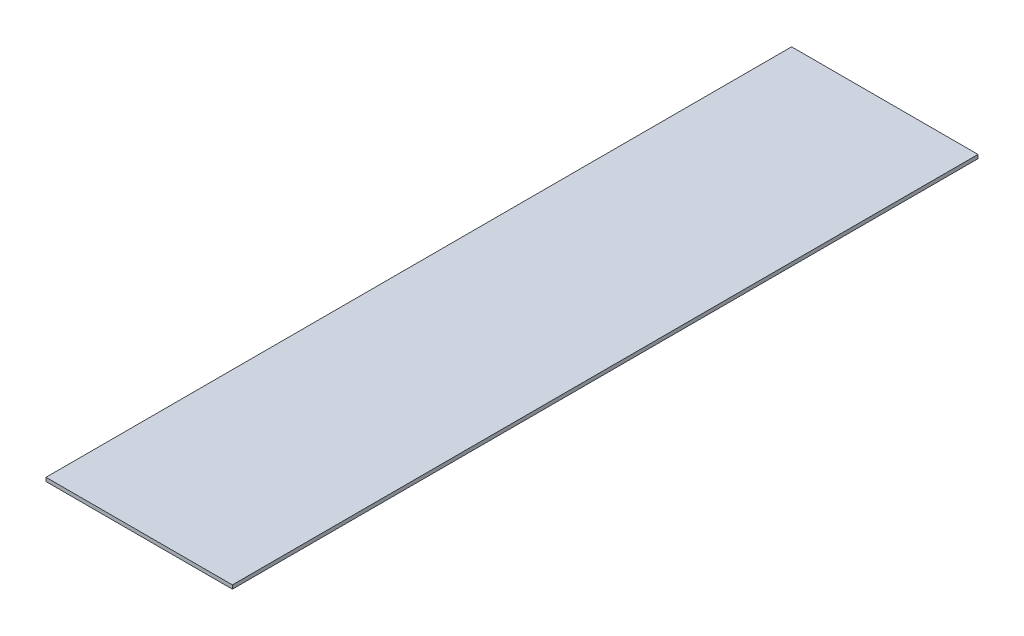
ISO-10303-21;
HEADER;
FILE_DESCRIPTION(('STEP AP214'),'2;1');
FILE_NAME('part.step','',(''),(''),'','','');
FILE_SCHEMA(('AUTOMOTIVE_DESIGN { 1 0 10303 214 1 1 1 1 }'));
ENDSEC;
DATA;
#1=APPLICATION_CONTEXT('core data for automotive mechanical design processes');
#2=APPLICATION_PROTOCOL_DEFINITION('international standard','automotive_design',2000,#1);
#3=PRODUCT_CONTEXT('',#1,'mechanical');
#4=PRODUCT('Part','Part','',(#3));
#5=PRODUCT_RELATED_PRODUCT_CATEGORY('part','',(#4));
#6=PRODUCT_DEFINITION_FORMATION('','',#4);
#7=PRODUCT_DEFINITION_CONTEXT('part definition',#1,'design');
#8=PRODUCT_DEFINITION('design','',#6,#7);
#9=PRODUCT_DEFINITION_SHAPE('','',#8);
#10=(LENGTH_UNIT() NAMED_UNIT(*) SI_UNIT(.MILLI.,.METRE.));
#11=(NAMED_UNIT(*) PLANE_ANGLE_UNIT() SI_UNIT($,.RADIAN.));
#12=(NAMED_UNIT(*) SI_UNIT($,.STERADIAN.) SOLID_ANGLE_UNIT());
#13=UNCERTAINTY_MEASURE_WITH_UNIT(LENGTH_MEASURE(1.E-05),#10,'distance_accuracy_value','');
#14=(GEOMETRIC_REPRESENTATION_CONTEXT(3) GLOBAL_UNCERTAINTY_ASSIGNED_CONTEXT((#13)) GLOBAL_UNIT_ASSIGNED_CONTEXT((#10,
#11,#12)) REPRESENTATION_CONTEXT('',''));
#15=CARTESIAN_POINT('',(0.,0.,0.));
#16=DIRECTION('',(0.,0.,1.));
#17=DIRECTION('',(1.,0.,0.));
#18=AXIS2_PLACEMENT_3D('',#15,#16,#17);
#19=CARTESIAN_POINT('',(152.4,2.54,0.));
#20=DIRECTION('',(-1.,0.,0.));
#21=DIRECTION('',(0.,0.,1.));
#22=AXIS2_PLACEMENT_3D('',#19,#20,#21);
#23=PLANE('',#22);
#24=DIRECTION('',(0.,1.,0.));
#25=VECTOR('',#24,1.);
#26=CARTESIAN_POINT('',(152.4,2.54,25.4));
#27=LINE('',#26,#25);
#28=CARTESIAN_POINT('',(152.4,2.413,25.4));
#29=VERTEX_POINT('',#28);
#30=CARTESIAN_POINT('',(152.4,2.667,25.4));
#31=VERTEX_POINT('',#30);
#32=EDGE_CURVE('E11',#29,#31,#27,.T.);
#33=ORIENTED_EDGE('',*,*,#32,.F.);
#34=DIRECTION('',(0.,0.,1.));
#35=VECTOR('',#34,1.);
#36=CARTESIAN_POINT('',(152.4,2.413,0.));
#37=LINE('',#36,#35);
#38=CARTESIAN_POINT('',(152.4,2.413,-25.4));
#39=VERTEX_POINT('',#38);
#40=EDGE_CURVE('E94',#29,#39,#37,.F.);
#41=ORIENTED_EDGE('',*,*,#40,.T.);
#42=DIRECTION('',(0.,1.,0.));
#43=VECTOR('',#42,1.);
#44=CARTESIAN_POINT('',(152.4,2.54,-25.4));
#45=LINE('',#44,#43);
#46=CARTESIAN_POINT('',(152.4,2.667,-25.4));
#47=VERTEX_POINT('',#46);
#48=EDGE_CURVE('E49',#39,#47,#45,.T.);
#49=ORIENTED_EDGE('',*,*,#48,.T.);
#50=DIRECTION('',(0.,0.,1.));
#51=VECTOR('',#50,1.);
#52=CARTESIAN_POINT('',(152.4,2.667,0.));
#53=LINE('',#52,#51);
#54=EDGE_CURVE('E107',#31,#47,#53,.F.);
#55=ORIENTED_EDGE('',*,*,#54,.F.);
#56=EDGE_LOOP('',(#33,#41,#49,#55));
#57=FACE_BOUND('',#56,.T.);
#58=ADVANCED_FACE('F39',(#57),#23,.F.);
#59=CARTESIAN_POINT('',(0.,2.54,-25.4));
#60=DIRECTION('',(0.,0.,1.));
#61=DIRECTION('',(1.,0.,0.));
#62=AXIS2_PLACEMENT_3D('',#59,#60,#61);
#63=PLANE('',#62);
#64=ORIENTED_EDGE('',*,*,#48,.F.);
#65=DIRECTION('',(1.,0.,0.));
#66=VECTOR('',#65,1.);
#67=CARTESIAN_POINT('',(0.,2.413,-25.4));
#68=LINE('',#67,#66);
#69=CARTESIAN_POINT('',(139.7,2.413,-25.4));
#70=VERTEX_POINT('',#69);
#71=EDGE_CURVE('E101',#39,#70,#68,.F.);
#72=ORIENTED_EDGE('',*,*,#71,.T.);
#73=DIRECTION('',(0.,1.,0.));
#74=VECTOR('',#73,1.);
#75=CARTESIAN_POINT('',(139.7,2.54,-25.4));
#76=LINE('',#75,#74);
#77=CARTESIAN_POINT('',(139.7,2.667,-25.4));
#78=VERTEX_POINT('',#77);
#79=EDGE_CURVE('E57',#70,#78,#76,.T.);
#80=ORIENTED_EDGE('',*,*,#79,.T.);
#81=DIRECTION('',(1.,0.,0.));
#82=VECTOR('',#81,1.);
#83=CARTESIAN_POINT('',(0.,2.667,-25.4));
#84=LINE('',#83,#82);
#85=EDGE_CURVE('E88',#47,#78,#84,.F.);
#86=ORIENTED_EDGE('',*,*,#85,.F.);
#87=EDGE_LOOP('',(#64,#72,#80,#86));
#88=FACE_BOUND('',#87,.T.);
#89=ADVANCED_FACE('F111',(#88),#63,.F.);
#90=CARTESIAN_POINT('',(139.7,2.54,0.));
#91=DIRECTION('',(-1.,0.,0.));
#92=DIRECTION('',(0.,0.,1.));
#93=AXIS2_PLACEMENT_3D('',#90,#91,#92);
#94=PLANE('',#93);
#95=ORIENTED_EDGE('',*,*,#79,.F.);
#96=DIRECTION('',(0.,0.,1.));
#97=VECTOR('',#96,1.);
#98=CARTESIAN_POINT('',(139.7,2.413,0.));
#99=LINE('',#98,#97);
#100=CARTESIAN_POINT('',(139.7,2.413,25.4));
#101=VERTEX_POINT('',#100);
#102=EDGE_CURVE('E93',#101,#70,#99,.F.);
#103=ORIENTED_EDGE('',*,*,#102,.F.);
#104=DIRECTION('',(0.,1.,0.));
#105=VECTOR('',#104,1.);
#106=CARTESIAN_POINT('',(139.7,2.54,25.4));
#107=LINE('',#106,#105);
#108=CARTESIAN_POINT('',(139.7,2.667,25.4));
#109=VERTEX_POINT('',#108);
#110=EDGE_CURVE('E43',#101,#109,#107,.T.);
#111=ORIENTED_EDGE('',*,*,#110,.T.);
#112=DIRECTION('',(0.,0.,1.));
#113=VECTOR('',#112,1.);
#114=CARTESIAN_POINT('',(139.7,2.667,0.));
#115=LINE('',#114,#113);
#116=EDGE_CURVE('E103',#109,#78,#115,.F.);
#117=ORIENTED_EDGE('',*,*,#116,.T.);
#118=EDGE_LOOP('',(#95,#103,#111,#117));
#119=FACE_BOUND('',#118,.T.);
#120=ADVANCED_FACE('F96',(#119),#94,.T.);
#121=CARTESIAN_POINT('',(0.,2.54,25.4));
#122=DIRECTION('',(0.,0.,1.));
#123=DIRECTION('',(1.,0.,0.));
#124=AXIS2_PLACEMENT_3D('',#121,#122,#123);
#125=PLANE('',#124);
#126=DIRECTION('',(1.,0.,0.));
#127=VECTOR('',#126,1.);
#128=CARTESIAN_POINT('',(0.,2.413,25.4));
#129=LINE('',#128,#127);
#130=EDGE_CURVE('E82',#101,#29,#129,.T.);
#131=ORIENTED_EDGE('',*,*,#130,.T.);
#132=ORIENTED_EDGE('',*,*,#32,.T.);
#133=DIRECTION('',(1.,0.,0.));
#134=VECTOR('',#133,1.);
#135=CARTESIAN_POINT('',(0.,2.667,25.4));
#136=LINE('',#135,#134);
#137=EDGE_CURVE('E84',#109,#31,#136,.T.);
#138=ORIENTED_EDGE('',*,*,#137,.F.);
#139=ORIENTED_EDGE('',*,*,#110,.F.);
#140=EDGE_LOOP('',(#131,#132,#138,#139));
#141=FACE_BOUND('',#140,.T.);
#142=ADVANCED_FACE('F41',(#141),#125,.T.);
#143=CARTESIAN_POINT('',(0.,2.667,0.));
#144=DIRECTION('',(0.,1.,0.));
#145=DIRECTION('',(0.,0.,1.));
#146=AXIS2_PLACEMENT_3D('',#143,#144,#145);
#147=PLANE('',#146);
#148=ORIENTED_EDGE('',*,*,#116,.F.);
#149=ORIENTED_EDGE('',*,*,#137,.T.);
#150=ORIENTED_EDGE('',*,*,#54,.T.);
#151=ORIENTED_EDGE('',*,*,#85,.T.);
#152=EDGE_LOOP('',(#148,#149,#150,#151));
#153=FACE_BOUND('',#152,.T.);
#154=ADVANCED_FACE('F110',(#153),#147,.T.);
#155=CARTESIAN_POINT('',(0.,2.413,0.));
#156=DIRECTION('',(0.,1.,0.));
#157=DIRECTION('',(0.,0.,1.));
#158=AXIS2_PLACEMENT_3D('',#155,#156,#157);
#159=PLANE('',#158);
#160=ORIENTED_EDGE('',*,*,#102,.T.);
#161=ORIENTED_EDGE('',*,*,#71,.F.);
#162=ORIENTED_EDGE('',*,*,#40,.F.);
#163=ORIENTED_EDGE('',*,*,#130,.F.);
#164=EDGE_LOOP('',(#160,#161,#162,#163));
#165=FACE_BOUND('',#164,.T.);
#166=ADVANCED_FACE('F91',(#165),#159,.F.);
#167=CLOSED_SHELL('',(#58,#89,#120,#142,#154,#166));
#168=MANIFOLD_SOLID_BREP('B2',#167);
#169=ADVANCED_BREP_SHAPE_REPRESENTATION('',(#18,#168),#14);
#170=SHAPE_DEFINITION_REPRESENTATION(#9,#169);
ENDSEC;
END-ISO-10303-21;
